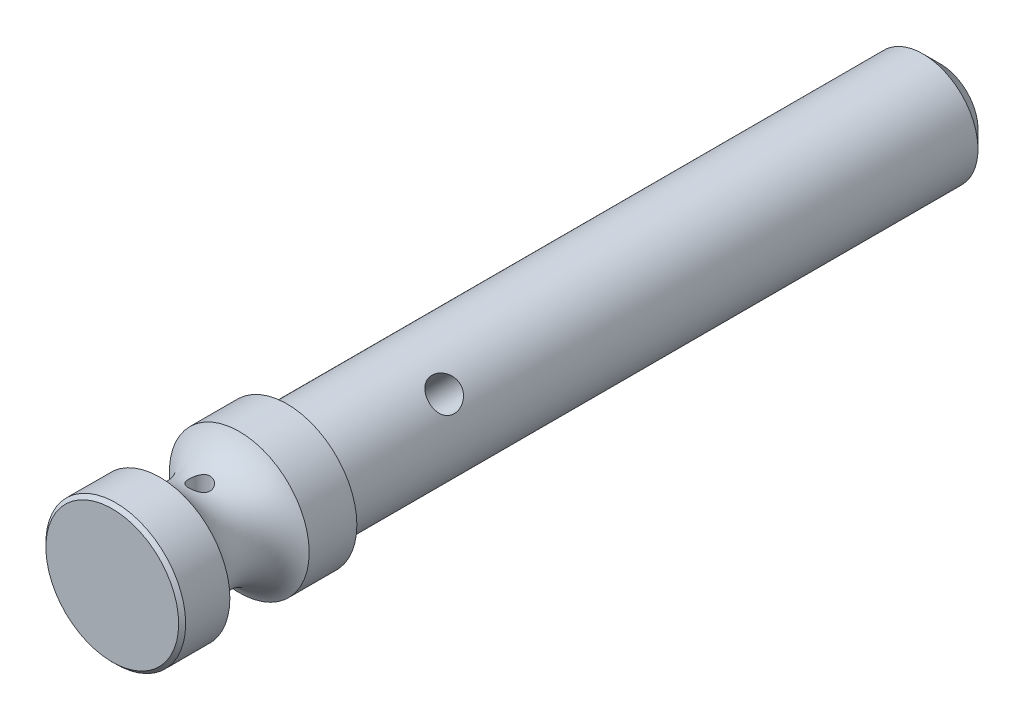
from build123d import *

# Parameters (mm, degrees)
SKETCH_1_R               = 4
EXTRUDE_1_DEPTH          = 10
SKETCH_2_R               = 3.15
EXTRUDE_2_DEPTH          = 37.4
SKETCH_3_R               = 2.5
CUT_EXTRUDE_1_DEPTH      = 48.736359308
CUT_EXTRUDE_1_DEPTH_BACK = 48.736359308
SKETCH_4_R               = 0.6
HOLE_WIZARD_1_8_1_8_1_D  = 1.8
CHAMFER_1_SIZE           = 1
CHAMFER_2_SIZE           = 0.2


with BuildPart() as part:
    # Sketch 1 → Extrude 1 (new body)
    with BuildSketch(Plane.XY):
        Circle(SKETCH_1_R)
    extrude(amount=-EXTRUDE_1_DEPTH)

    # Sketch 2 → Extrude 2 (add)
    with BuildSketch(Plane(origin=(0, 0, -10), x_dir=(-1, 0, 0), z_dir=(0, 0, -1))):
        Circle(SKETCH_2_R)
    extrude(amount=EXTRUDE_2_DEPTH)

    # Sketch 3 → Cut-Revolve 1 (revolve, cut)
    with BuildSketch(Plane(origin=(0, 0, 0), x_dir=(1, 0, 0), z_dir=(0, 1, 0)), mode=Mode.PRIVATE) as cut_revolve_1_sk:
        with Locations((-5.05, 5)):
            Circle(SKETCH_3_R)
    revolve(cut_revolve_1_sk.sketch.rotate(Axis((0, 0, 0), (0, 0, -1)), 180), axis=Axis((0, 0, 0), (0, 0, -1)), mode=Mode.SUBTRACT)

    # Sketch 4 → Cut-Extrude 1 (cut, two sides: drawn at the far end of the back side and taken through both)
    with BuildSketch(Plane(origin=(0, 0, 0), x_dir=(1, 0, 0), z_dir=(0, 1, 0)).offset(-CUT_EXTRUDE_1_DEPTH_BACK)):
        with Locations(Location((0, 5, 0), (0, 0, 139.612710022))):
            Circle(SKETCH_4_R)
    extrude(amount=CUT_EXTRUDE_1_DEPTH + CUT_EXTRUDE_1_DEPTH_BACK, mode=Mode.SUBTRACT)

    # Hole Wizard 1.8 _1.8_ _1 (through all)
    with Locations(Plane(origin=(2.227386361, 2.227386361, -16.8), x_dir=(-0.707106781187, 0.707106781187, 0), z_dir=(0.707106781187, 0.707106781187, 0))):
        with Locations((0, 0)):
            Hole(HOLE_WIZARD_1_8_1_8_1_D / 2)

    # Chamfer 1
    chamfer_1_edges = [part.edges().sort_by_distance(p)[0] for p in [
        (3.15, 0, -47.4),
    ]]
    chamfer(chamfer_1_edges, length=CHAMFER_1_SIZE)

    # Chamfer 2
    chamfer_2_edges = [part.edges().sort_by_distance(p)[0] for p in [
        (-4, 0, 0),
    ]]
    chamfer(chamfer_2_edges, length=CHAMFER_2_SIZE)


solid = part.part
